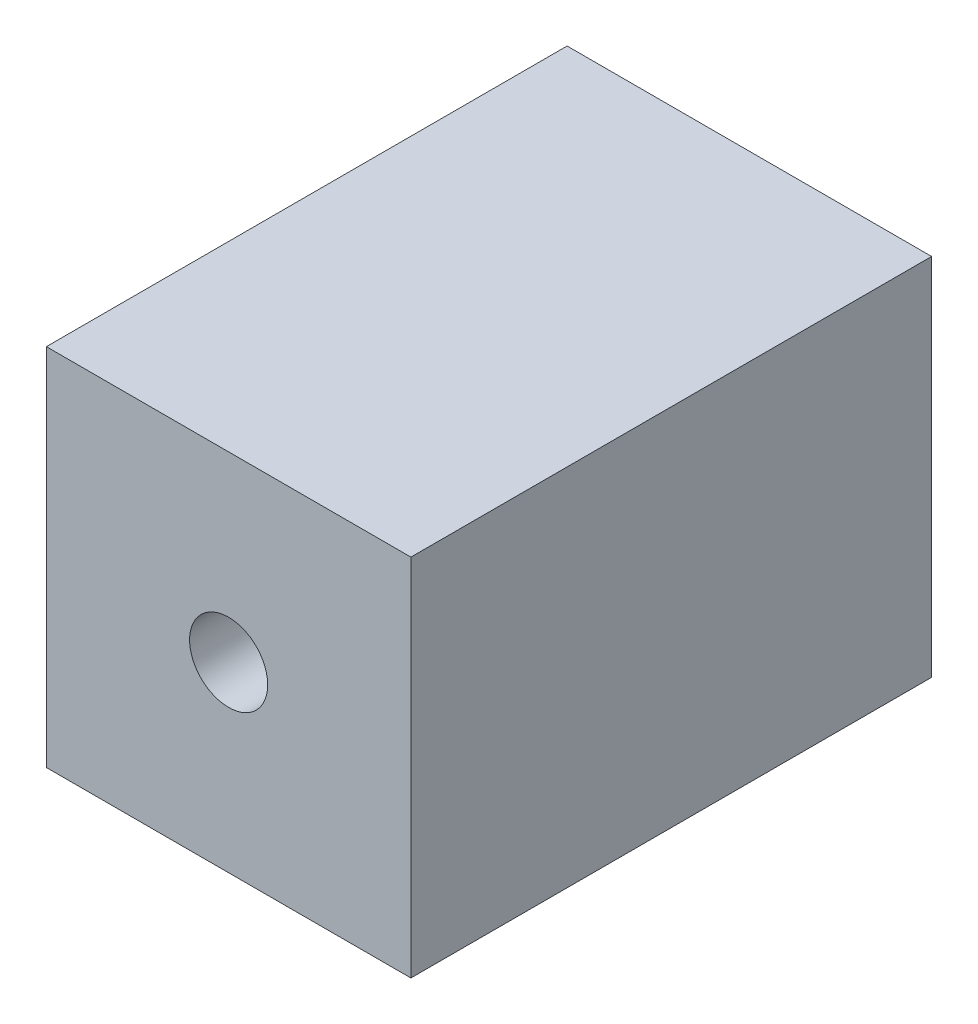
from build123d import *

# Parameters (mm, degrees)
SKETCH_1_W      = 28
SKETCH_1_H      = 28
SKETCH_1_R      = 3
EXTRUDE_1_DEPTH = 40


with BuildPart() as part:
    # Sketch 1 → Extrude 1 (new body)
    with BuildSketch(Plane.XY):
        Rectangle(SKETCH_1_W, SKETCH_1_H)
        Circle(SKETCH_1_R, mode=Mode.SUBTRACT)
    extrude(amount=EXTRUDE_1_DEPTH)


solid = part.part
